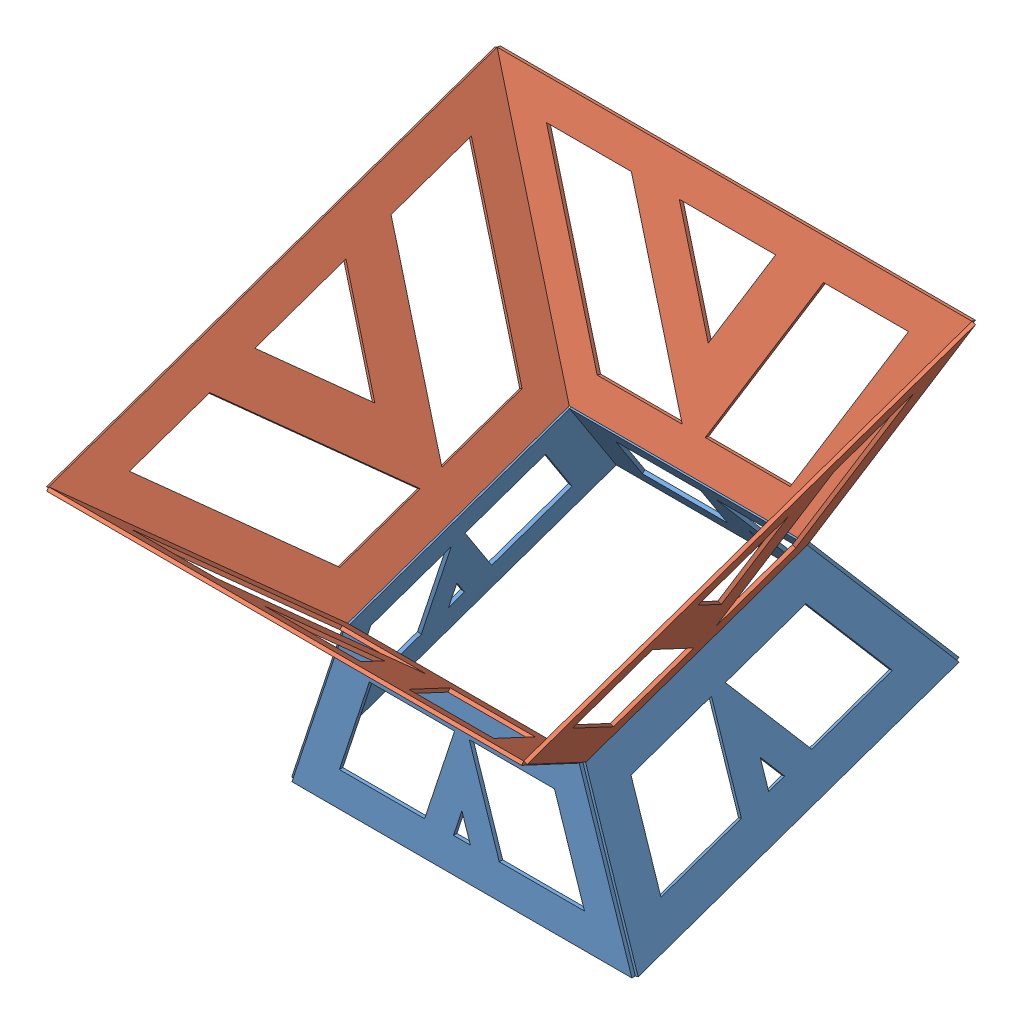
SolidWorks assembly base2 complete.SLDASM, configuration Default (file format 8000). Lengths in mm.
Overall size (890.2 1019.95 1086.26).
10 component instances, 2 part files, 2 mates.
Components (placement in the parent):
- base2-tier1-1: base2-tier1.SLDASM [Default] at (-389.5691 -72.3187 234.6343) size (641.44 472.69 691.8)
  - Base-2-tier-1: Base-2-tier.SLDPRT [Default] at (399.4513 -22.7257 634.9553) size (629.45 295.21 6.35)
  - Base-2-tier-2: Base-2-tier.SLDPRT [Default] at (-58.7885 102.7833 275.7433) x (0 -0.329847 0.944034) z (-0.944034 0.311387 0.108799) size (629.45 295.21 6.35)
  - Base-2-tier-3: Base-2-tier.SLDPRT [Default] at (399.4513 257.8869 -161.8191) x (1 0 0) z (0 -0.622773 0.782402) size (629.45 295.21 6.35)
  - Base-2-tier-4: Base-2-tier.SLDPRT [Default] at (779.9585 128.4232 202.361) x (0 0.329847 -0.944034) z (0.944034 0.311387 0.108799) size (629.45 295.21 6.35)
- base2-tier2-1: base2-tier2.SLDASM [Default] at (-355.6529 289.7699 -162.2429) x (1 0 0) z (0 0.207011 0.978339) size (890.2 772.31 946.89)
  - Base-2-tier2-2: Base-2-tier2.SLDPRT [Default] at (232.6721 -344.3629 633.1329) x (0 -0.518128 0.855303) z (-0.855303 0.443156 0.268456) size (879.34 429.08 6.35)
  - Base-2-tier2-3: Base-2-tier2.SLDPRT [Default] at (366.0986 -269.6028 516.0722) x (1 0 0) z (0 -0.886313 0.463087) size (879.34 429.08 6.35)
  - Base-2-tier2-4: Base-2-tier2.SLDPRT [Default] at (421.7924 -304.0874 566.648) x (0 0.518128 -0.855303) z (0.855303 0.443156 0.268456) size (879.34 429.08 6.35)
  - Base-2-tier2-5: Base-2-tier2.SLDPRT [Default] at (366.0986 -373.2194 680.7681) size (879.34 429.08 6.35)
Mates (geometry in assembly coordinates):
- Coincident1: coincident aligned: line of base2-tier1-1/Base-2-tier-4 through (194.3605 662.7943 459.9088) axis (0 -0.329847 0.944034); line of base2-tier2-1/Base-2-tier2-2 through (194.3605 662.9801 459.3769) axis (0 -0.329847 0.944034)
- Coincident2: coincident: line of base2-tier1-1/Base-2-tier-3 through (188.3659 664.7716 454.2496) axis (-1 0 0); line of base2-tier2-1/Base-2-tier2-5 through (-245.7706 664.7716 454.2496) axis (1 0 0)
